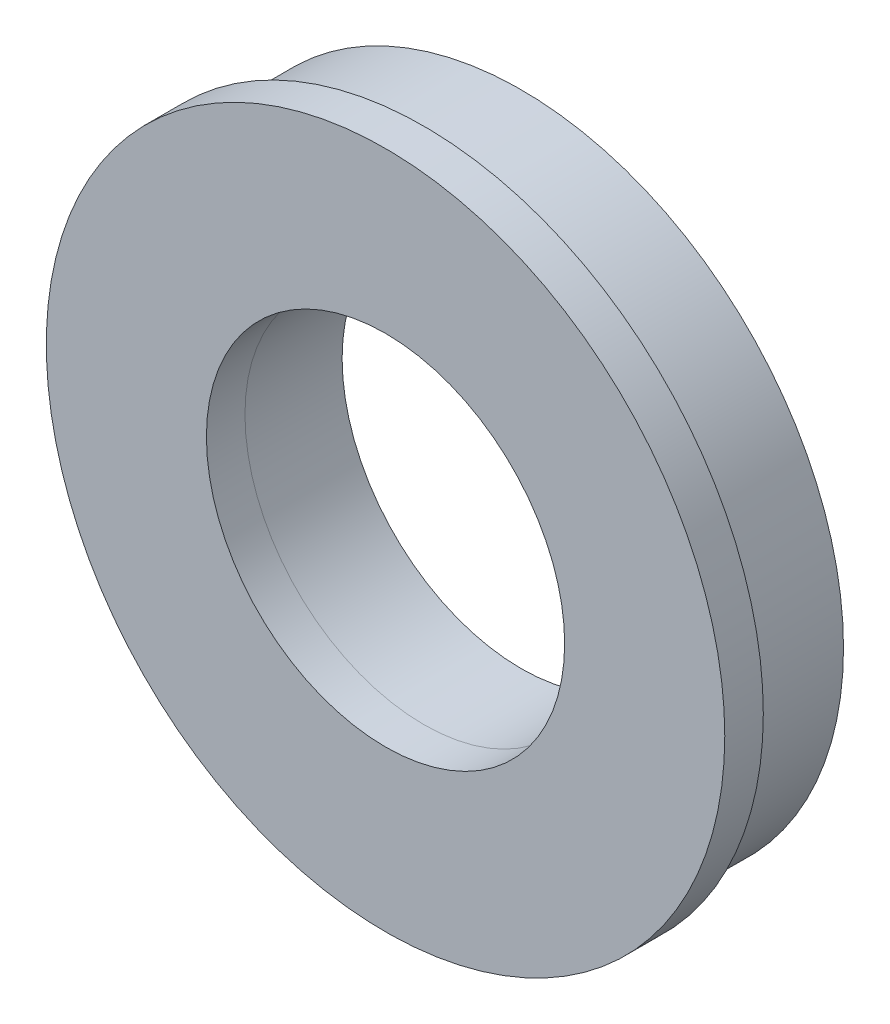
ISO-10303-21;
HEADER;
FILE_DESCRIPTION(('STEP AP214'),'2;1');
FILE_NAME('part.step','',(''),(''),'','','');
FILE_SCHEMA(('AUTOMOTIVE_DESIGN { 1 0 10303 214 1 1 1 1 }'));
ENDSEC;
DATA;
#1=APPLICATION_CONTEXT('core data for automotive mechanical design processes');
#2=APPLICATION_PROTOCOL_DEFINITION('international standard','automotive_design',2000,#1);
#3=PRODUCT_CONTEXT('',#1,'mechanical');
#4=PRODUCT('Part','Part','',(#3));
#5=PRODUCT_RELATED_PRODUCT_CATEGORY('part','',(#4));
#6=PRODUCT_DEFINITION_FORMATION('','',#4);
#7=PRODUCT_DEFINITION_CONTEXT('part definition',#1,'design');
#8=PRODUCT_DEFINITION('design','',#6,#7);
#9=PRODUCT_DEFINITION_SHAPE('','',#8);
#10=(LENGTH_UNIT() NAMED_UNIT(*) SI_UNIT(.MILLI.,.METRE.));
#11=(NAMED_UNIT(*) PLANE_ANGLE_UNIT() SI_UNIT($,.RADIAN.));
#12=(NAMED_UNIT(*) SI_UNIT($,.STERADIAN.) SOLID_ANGLE_UNIT());
#13=UNCERTAINTY_MEASURE_WITH_UNIT(LENGTH_MEASURE(1.E-05),#10,'distance_accuracy_value','');
#14=(GEOMETRIC_REPRESENTATION_CONTEXT(3) GLOBAL_UNCERTAINTY_ASSIGNED_CONTEXT((#13)) GLOBAL_UNIT_ASSIGNED_CONTEXT((#10,
#11,#12)) REPRESENTATION_CONTEXT('',''));
#15=CARTESIAN_POINT('',(0.,0.,0.));
#16=DIRECTION('',(0.,0.,1.));
#17=DIRECTION('',(1.,0.,0.));
#18=AXIS2_PLACEMENT_3D('',#15,#16,#17);
#19=CARTESIAN_POINT('',(0.,0.,-0.9017));
#20=DIRECTION('',(0.,0.,-1.));
#21=DIRECTION('',(-1.,0.,0.));
#22=AXIS2_PLACEMENT_3D('',#19,#20,#21);
#23=PLANE('',#22);
#24=CARTESIAN_POINT('',(0.,0.,-0.9017));
#25=DIRECTION('',(0.,0.,-1.));
#26=DIRECTION('',(-1.,0.,0.));
#27=AXIS2_PLACEMENT_3D('',#24,#25,#26);
#28=CIRCLE('',#27,7.540625);
#29=CARTESIAN_POINT('',(-7.540625,0.,-0.9017));
#30=VERTEX_POINT('',#29);
#31=EDGE_CURVE('E53',#30,#30,#28,.T.);
#32=ORIENTED_EDGE('',*,*,#31,.F.);
#33=EDGE_LOOP('',(#32));
#34=FACE_BOUND('',#33,.T.);
#35=CARTESIAN_POINT('',(0.,0.,-0.9017));
#36=DIRECTION('',(0.,0.,-1.));
#37=DIRECTION('',(-1.,0.,0.));
#38=AXIS2_PLACEMENT_3D('',#35,#36,#37);
#39=CIRCLE('',#38,4.191);
#40=CARTESIAN_POINT('',(-4.191,0.,-0.9017));
#41=VERTEX_POINT('',#40);
#42=EDGE_CURVE('E65',#41,#41,#39,.T.);
#43=ORIENTED_EDGE('',*,*,#42,.T.);
#44=EDGE_LOOP('',(#43));
#45=FACE_BOUND('',#44,.T.);
#46=ADVANCED_FACE('F45',(#34,#45),#23,.F.);
#47=CARTESIAN_POINT('',(0.,0.,-27.6781082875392));
#48=DIRECTION('',(0.,0.,1.));
#49=DIRECTION('',(1.,0.,0.));
#50=AXIS2_PLACEMENT_3D('',#47,#48,#49);
#51=CYLINDRICAL_SURFACE('',#50,7.540625);
#52=CARTESIAN_POINT('',(0.,0.,-3.175));
#53=DIRECTION('',(0.,0.,1.));
#54=DIRECTION('',(1.,0.,0.));
#55=AXIS2_PLACEMENT_3D('',#52,#53,#54);
#56=CIRCLE('',#55,7.540625);
#57=CARTESIAN_POINT('',(7.540625,0.,-3.175));
#58=VERTEX_POINT('',#57);
#59=EDGE_CURVE('E60',#58,#58,#56,.T.);
#60=ORIENTED_EDGE('',*,*,#59,.T.);
#61=EDGE_LOOP('',(#60));
#62=FACE_BOUND('',#61,.T.);
#63=ORIENTED_EDGE('',*,*,#31,.T.);
#64=EDGE_LOOP('',(#63));
#65=FACE_BOUND('',#64,.T.);
#66=ADVANCED_FACE('F73',(#62,#65),#51,.T.);
#67=CARTESIAN_POINT('',(0.,0.,-27.6781082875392));
#68=DIRECTION('',(0.,0.,1.));
#69=DIRECTION('',(1.,0.,0.));
#70=AXIS2_PLACEMENT_3D('',#67,#68,#69);
#71=CYLINDRICAL_SURFACE('',#70,4.191);
#72=CARTESIAN_POINT('',(0.,0.,-3.175));
#73=DIRECTION('',(0.,0.,1.));
#74=DIRECTION('',(1.,0.,0.));
#75=AXIS2_PLACEMENT_3D('',#72,#73,#74);
#76=CIRCLE('',#75,4.191);
#77=CARTESIAN_POINT('',(4.191,0.,-3.175));
#78=VERTEX_POINT('',#77);
#79=EDGE_CURVE('E11',#78,#78,#76,.T.);
#80=ORIENTED_EDGE('',*,*,#79,.F.);
#81=EDGE_LOOP('',(#80));
#82=FACE_BOUND('',#81,.T.);
#83=ORIENTED_EDGE('',*,*,#42,.F.);
#84=EDGE_LOOP('',(#83));
#85=FACE_BOUND('',#84,.T.);
#86=ADVANCED_FACE('F71',(#82,#85),#71,.F.);
#87=CARTESIAN_POINT('',(0.,0.,-3.175));
#88=DIRECTION('',(0.,0.,1.));
#89=DIRECTION('',(1.,0.,0.));
#90=AXIS2_PLACEMENT_3D('',#87,#88,#89);
#91=PLANE('',#90);
#92=ORIENTED_EDGE('',*,*,#79,.T.);
#93=EDGE_LOOP('',(#92));
#94=FACE_BOUND('',#93,.T.);
#95=ORIENTED_EDGE('',*,*,#59,.F.);
#96=EDGE_LOOP('',(#95));
#97=FACE_BOUND('',#96,.T.);
#98=ADVANCED_FACE('F47',(#94,#97),#91,.F.);
#99=CLOSED_SHELL('',(#46,#66,#86,#98));
#100=MANIFOLD_SOLID_BREP('B2',#99);
#101=CARTESIAN_POINT('',(0.,0.,-0.9017));
#102=DIRECTION('',(0.,0.,1.));
#103=DIRECTION('',(1.,0.,0.));
#104=AXIS2_PLACEMENT_3D('',#101,#102,#103);
#105=CYLINDRICAL_SURFACE('',#104,7.9375);
#106=CARTESIAN_POINT('',(0.,0.,-0.9017));
#107=DIRECTION('',(0.,0.,1.));
#108=DIRECTION('',(1.,0.,0.));
#109=AXIS2_PLACEMENT_3D('',#106,#107,#108);
#110=CIRCLE('',#109,7.9375);
#111=CARTESIAN_POINT('',(7.9375,0.,-0.9017));
#112=VERTEX_POINT('',#111);
#113=EDGE_CURVE('E44',#112,#112,#110,.T.);
#114=ORIENTED_EDGE('',*,*,#113,.T.);
#115=EDGE_LOOP('',(#114));
#116=FACE_BOUND('',#115,.T.);
#117=CARTESIAN_POINT('',(0.,0.,0.));
#118=DIRECTION('',(0.,0.,1.));
#119=DIRECTION('',(1.,0.,0.));
#120=AXIS2_PLACEMENT_3D('',#117,#118,#119);
#121=CIRCLE('',#120,7.9375);
#122=CARTESIAN_POINT('',(7.9375,0.,0.));
#123=VERTEX_POINT('',#122);
#124=EDGE_CURVE('E114',#123,#123,#121,.T.);
#125=ORIENTED_EDGE('',*,*,#124,.F.);
#126=EDGE_LOOP('',(#125));
#127=FACE_BOUND('',#126,.T.);
#128=ADVANCED_FACE('F111',(#116,#127),#105,.T.);
#129=CARTESIAN_POINT('',(0.,0.,-0.9017));
#130=DIRECTION('',(0.,0.,1.));
#131=DIRECTION('',(1.,0.,0.));
#132=AXIS2_PLACEMENT_3D('',#129,#130,#131);
#133=PLANE('',#132);
#134=CARTESIAN_POINT('',(0.,0.,-0.9017));
#135=DIRECTION('',(0.,0.,1.));
#136=DIRECTION('',(1.,0.,0.));
#137=AXIS2_PLACEMENT_3D('',#134,#135,#136);
#138=CIRCLE('',#137,4.191);
#139=CARTESIAN_POINT('',(4.191,0.,-0.9017));
#140=VERTEX_POINT('',#139);
#141=EDGE_CURVE('E123',#140,#140,#138,.T.);
#142=ORIENTED_EDGE('',*,*,#141,.T.);
#143=EDGE_LOOP('',(#142));
#144=FACE_BOUND('',#143,.T.);
#145=ORIENTED_EDGE('',*,*,#113,.F.);
#146=EDGE_LOOP('',(#145));
#147=FACE_BOUND('',#146,.T.);
#148=ADVANCED_FACE('F133',(#144,#147),#133,.F.);
#149=CARTESIAN_POINT('',(0.,0.,0.));
#150=DIRECTION('',(0.,0.,1.));
#151=DIRECTION('',(1.,0.,0.));
#152=AXIS2_PLACEMENT_3D('',#149,#150,#151);
#153=PLANE('',#152);
#154=CARTESIAN_POINT('',(0.,0.,0.));
#155=DIRECTION('',(0.,0.,1.));
#156=DIRECTION('',(1.,0.,0.));
#157=AXIS2_PLACEMENT_3D('',#154,#155,#156);
#158=CIRCLE('',#157,4.191);
#159=CARTESIAN_POINT('',(4.191,0.,0.));
#160=VERTEX_POINT('',#159);
#161=EDGE_CURVE('E125',#160,#160,#158,.T.);
#162=ORIENTED_EDGE('',*,*,#161,.F.);
#163=EDGE_LOOP('',(#162));
#164=FACE_BOUND('',#163,.T.);
#165=ORIENTED_EDGE('',*,*,#124,.T.);
#166=EDGE_LOOP('',(#165));
#167=FACE_BOUND('',#166,.T.);
#168=ADVANCED_FACE('F139',(#164,#167),#153,.T.);
#169=CARTESIAN_POINT('',(0.,0.,-0.9017));
#170=DIRECTION('',(0.,0.,1.));
#171=DIRECTION('',(1.,0.,0.));
#172=AXIS2_PLACEMENT_3D('',#169,#170,#171);
#173=CYLINDRICAL_SURFACE('',#172,4.191);
#174=ORIENTED_EDGE('',*,*,#141,.F.);
#175=EDGE_LOOP('',(#174));
#176=FACE_BOUND('',#175,.T.);
#177=ORIENTED_EDGE('',*,*,#161,.T.);
#178=EDGE_LOOP('',(#177));
#179=FACE_BOUND('',#178,.T.);
#180=ADVANCED_FACE('F136',(#176,#179),#173,.F.);
#181=CLOSED_SHELL('',(#128,#148,#168,#180));
#182=MANIFOLD_SOLID_BREP('B6',#181);
#183=ADVANCED_BREP_SHAPE_REPRESENTATION('',(#18,#100,#182),#14);
#184=SHAPE_DEFINITION_REPRESENTATION(#9,#183);
ENDSEC;
END-ISO-10303-21;
